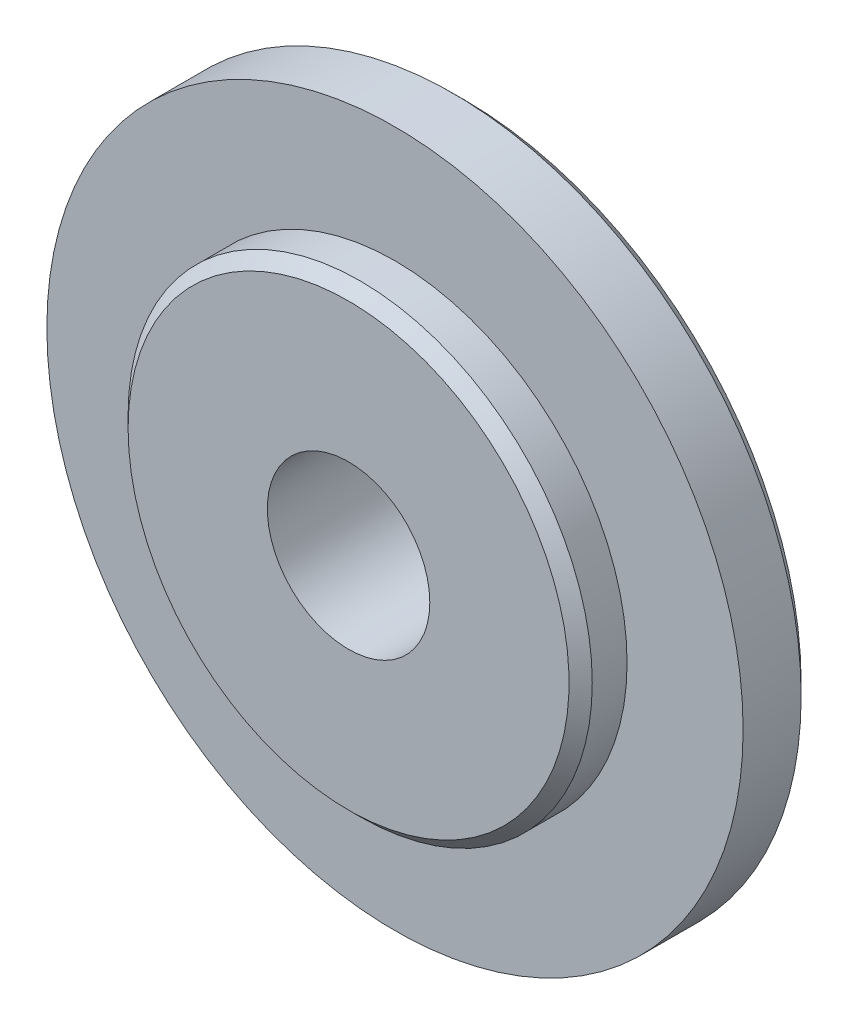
ISO-10303-21;
HEADER;
FILE_DESCRIPTION(('STEP AP214'),'2;1');
FILE_NAME('part.step','',(''),(''),'','','');
FILE_SCHEMA(('AUTOMOTIVE_DESIGN { 1 0 10303 214 1 1 1 1 }'));
ENDSEC;
DATA;
#1=APPLICATION_CONTEXT('core data for automotive mechanical design processes');
#2=APPLICATION_PROTOCOL_DEFINITION('international standard','automotive_design',2000,#1);
#3=PRODUCT_CONTEXT('',#1,'mechanical');
#4=PRODUCT('Part','Part','',(#3));
#5=PRODUCT_RELATED_PRODUCT_CATEGORY('part','',(#4));
#6=PRODUCT_DEFINITION_FORMATION('','',#4);
#7=PRODUCT_DEFINITION_CONTEXT('part definition',#1,'design');
#8=PRODUCT_DEFINITION('design','',#6,#7);
#9=PRODUCT_DEFINITION_SHAPE('','',#8);
#10=(LENGTH_UNIT() NAMED_UNIT(*) SI_UNIT(.MILLI.,.METRE.));
#11=(NAMED_UNIT(*) PLANE_ANGLE_UNIT() SI_UNIT($,.RADIAN.));
#12=(NAMED_UNIT(*) SI_UNIT($,.STERADIAN.) SOLID_ANGLE_UNIT());
#13=UNCERTAINTY_MEASURE_WITH_UNIT(LENGTH_MEASURE(1.E-05),#10,'distance_accuracy_value','');
#14=(GEOMETRIC_REPRESENTATION_CONTEXT(3) GLOBAL_UNCERTAINTY_ASSIGNED_CONTEXT((#13)) GLOBAL_UNIT_ASSIGNED_CONTEXT((#10,
#11,#12)) REPRESENTATION_CONTEXT('',''));
#15=CARTESIAN_POINT('',(0.,0.,0.));
#16=DIRECTION('',(0.,0.,1.));
#17=DIRECTION('',(1.,0.,0.));
#18=AXIS2_PLACEMENT_3D('',#15,#16,#17);
#19=CARTESIAN_POINT('',(0.,0.,6.));
#20=DIRECTION('',(0.,0.,1.));
#21=DIRECTION('',(1.,0.,0.));
#22=AXIS2_PLACEMENT_3D('',#19,#20,#21);
#23=CYLINDRICAL_SURFACE('',#22,20.);
#24=CARTESIAN_POINT('',(0.,0.,6.));
#25=DIRECTION('',(0.,0.,1.));
#26=DIRECTION('',(1.,0.,0.));
#27=AXIS2_PLACEMENT_3D('',#24,#25,#26);
#28=CIRCLE('',#27,20.);
#29=CARTESIAN_POINT('',(20.,0.,6.));
#30=VERTEX_POINT('',#29);
#31=EDGE_CURVE('E18',#30,#30,#28,.T.);
#32=ORIENTED_EDGE('',*,*,#31,.T.);
#33=EDGE_LOOP('',(#32));
#34=FACE_BOUND('',#33,.T.);
#35=CARTESIAN_POINT('',(0.,0.,8.99999999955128));
#36=DIRECTION('',(0.,0.,-1.));
#37=DIRECTION('',(-1.,0.,0.));
#38=AXIS2_PLACEMENT_3D('',#35,#36,#37);
#39=CIRCLE('',#38,19.9999999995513);
#40=CARTESIAN_POINT('',(-19.9999999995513,0.,8.99999999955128));
#41=VERTEX_POINT('',#40);
#42=EDGE_CURVE('E30',#41,#41,#39,.F.);
#43=ORIENTED_EDGE('',*,*,#42,.F.);
#44=EDGE_LOOP('',(#43));
#45=FACE_BOUND('',#44,.T.);
#46=ADVANCED_FACE('F14',(#34,#45),#23,.T.);
#47=CARTESIAN_POINT('',(0.,0.,6.));
#48=DIRECTION('',(0.,0.,-1.));
#49=DIRECTION('',(-1.,0.,0.));
#50=AXIS2_PLACEMENT_3D('',#47,#48,#49);
#51=PLANE('',#50);
#52=ORIENTED_EDGE('',*,*,#31,.F.);
#53=EDGE_LOOP('',(#52));
#54=FACE_BOUND('',#53,.T.);
#55=CARTESIAN_POINT('',(0.,0.,6.));
#56=DIRECTION('',(0.,0.,1.));
#57=DIRECTION('',(1.,0.,0.));
#58=AXIS2_PLACEMENT_3D('',#55,#56,#57);
#59=CIRCLE('',#58,30.);
#60=CARTESIAN_POINT('',(30.,0.,6.));
#61=VERTEX_POINT('',#60);
#62=EDGE_CURVE('E38',#61,#61,#59,.F.);
#63=ORIENTED_EDGE('',*,*,#62,.F.);
#64=EDGE_LOOP('',(#63));
#65=FACE_BOUND('',#64,.T.);
#66=ADVANCED_FACE('F50',(#54,#65),#51,.F.);
#67=CARTESIAN_POINT('',(0.,0.,8.99999999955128));
#68=DIRECTION('',(0.,0.,-1.));
#69=DIRECTION('',(-1.,0.,0.));
#70=AXIS2_PLACEMENT_3D('',#67,#68,#69);
#71=CONICAL_SURFACE('',#70,19.9999999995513,0.785398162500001);
#72=ORIENTED_EDGE('',*,*,#42,.T.);
#73=EDGE_LOOP('',(#72));
#74=FACE_BOUND('',#73,.T.);
#75=CARTESIAN_POINT('',(0.,0.,10.0000000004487));
#76=DIRECTION('',(0.,0.,-1.));
#77=DIRECTION('',(-1.,0.,0.));
#78=AXIS2_PLACEMENT_3D('',#75,#76,#77);
#79=CIRCLE('',#78,19.0000000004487);
#80=CARTESIAN_POINT('',(-19.0000000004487,0.,10.0000000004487));
#81=VERTEX_POINT('',#80);
#82=EDGE_CURVE('E36',#81,#81,#79,.T.);
#83=ORIENTED_EDGE('',*,*,#82,.T.);
#84=EDGE_LOOP('',(#83));
#85=FACE_BOUND('',#84,.T.);
#86=ADVANCED_FACE('F53',(#74,#85),#71,.T.);
#87=CARTESIAN_POINT('',(0.,0.,0.));
#88=DIRECTION('',(0.,0.,1.));
#89=DIRECTION('',(1.,0.,0.));
#90=AXIS2_PLACEMENT_3D('',#87,#88,#89);
#91=CYLINDRICAL_SURFACE('',#90,30.);
#92=CARTESIAN_POINT('',(0.,0.,1.00000000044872));
#93=DIRECTION('',(0.,0.,1.));
#94=DIRECTION('',(-1.,0.,0.));
#95=AXIS2_PLACEMENT_3D('',#92,#93,#94);
#96=CIRCLE('',#95,29.9999999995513);
#97=CARTESIAN_POINT('',(-29.9999999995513,0.,1.00000000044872));
#98=VERTEX_POINT('',#97);
#99=EDGE_CURVE('E35',#98,#98,#96,.F.);
#100=ORIENTED_EDGE('',*,*,#99,.F.);
#101=EDGE_LOOP('',(#100));
#102=FACE_BOUND('',#101,.T.);
#103=ORIENTED_EDGE('',*,*,#62,.T.);
#104=EDGE_LOOP('',(#103));
#105=FACE_BOUND('',#104,.T.);
#106=ADVANCED_FACE('F58',(#102,#105),#91,.T.);
#107=CARTESIAN_POINT('',(0.,0.,10.));
#108=DIRECTION('',(0.,0.,-1.));
#109=DIRECTION('',(-1.,0.,0.));
#110=AXIS2_PLACEMENT_3D('',#107,#108,#109);
#111=PLANE('',#110);
#112=CARTESIAN_POINT('',(0.,0.,10.));
#113=DIRECTION('',(0.,0.,1.));
#114=DIRECTION('',(1.,0.,0.));
#115=AXIS2_PLACEMENT_3D('',#112,#113,#114);
#116=CIRCLE('',#115,7.);
#117=CARTESIAN_POINT('',(7.,0.,10.));
#118=VERTEX_POINT('',#117);
#119=EDGE_CURVE('E27',#118,#118,#116,.F.);
#120=ORIENTED_EDGE('',*,*,#119,.T.);
#121=EDGE_LOOP('',(#120));
#122=FACE_BOUND('',#121,.T.);
#123=ORIENTED_EDGE('',*,*,#82,.F.);
#124=EDGE_LOOP('',(#123));
#125=FACE_BOUND('',#124,.T.);
#126=ADVANCED_FACE('F72',(#122,#125),#111,.F.);
#127=CARTESIAN_POINT('',(0.,0.,1.00000000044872));
#128=DIRECTION('',(0.,0.,1.));
#129=DIRECTION('',(0.,-1.,0.));
#130=AXIS2_PLACEMENT_3D('',#127,#128,#129);
#131=CONICAL_SURFACE('',#130,29.9999999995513,0.7853981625);
#132=CARTESIAN_POINT('',(0.,0.,-4.48720921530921E-10));
#133=DIRECTION('',(0.,0.,1.));
#134=DIRECTION('',(0.,-1.,0.));
#135=AXIS2_PLACEMENT_3D('',#132,#133,#134);
#136=CIRCLE('',#135,29.0000000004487);
#137=CARTESIAN_POINT('',(0.,-29.0000000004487,-4.48721026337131E-10));
#138=VERTEX_POINT('',#137);
#139=EDGE_CURVE('E22',#138,#138,#136,.F.);
#140=ORIENTED_EDGE('',*,*,#139,.F.);
#141=EDGE_LOOP('',(#140));
#142=FACE_BOUND('',#141,.T.);
#143=ORIENTED_EDGE('',*,*,#99,.T.);
#144=EDGE_LOOP('',(#143));
#145=FACE_BOUND('',#144,.T.);
#146=ADVANCED_FACE('F66',(#142,#145),#131,.T.);
#147=CARTESIAN_POINT('',(0.,0.,0.));
#148=DIRECTION('',(0.,0.,1.));
#149=DIRECTION('',(1.,0.,0.));
#150=AXIS2_PLACEMENT_3D('',#147,#148,#149);
#151=CYLINDRICAL_SURFACE('',#150,7.);
#152=CARTESIAN_POINT('',(0.,0.,0.));
#153=DIRECTION('',(0.,0.,1.));
#154=DIRECTION('',(1.,0.,0.));
#155=AXIS2_PLACEMENT_3D('',#152,#153,#154);
#156=CIRCLE('',#155,7.);
#157=CARTESIAN_POINT('',(7.,0.,0.));
#158=VERTEX_POINT('',#157);
#159=EDGE_CURVE('E9',#158,#158,#156,.T.);
#160=ORIENTED_EDGE('',*,*,#159,.F.);
#161=EDGE_LOOP('',(#160));
#162=FACE_BOUND('',#161,.T.);
#163=ORIENTED_EDGE('',*,*,#119,.F.);
#164=EDGE_LOOP('',(#163));
#165=FACE_BOUND('',#164,.T.);
#166=ADVANCED_FACE('F16',(#162,#165),#151,.F.);
#167=CARTESIAN_POINT('',(0.,0.,0.));
#168=DIRECTION('',(0.,0.,-1.));
#169=DIRECTION('',(-1.,0.,0.));
#170=AXIS2_PLACEMENT_3D('',#167,#168,#169);
#171=PLANE('',#170);
#172=ORIENTED_EDGE('',*,*,#159,.T.);
#173=EDGE_LOOP('',(#172));
#174=FACE_BOUND('',#173,.T.);
#175=ORIENTED_EDGE('',*,*,#139,.T.);
#176=EDGE_LOOP('',(#175));
#177=FACE_BOUND('',#176,.T.);
#178=ADVANCED_FACE('F62',(#174,#177),#171,.T.);
#179=CLOSED_SHELL('',(#46,#66,#86,#106,#126,#146,#166,#178));
#180=MANIFOLD_SOLID_BREP('B1',#179);
#181=ADVANCED_BREP_SHAPE_REPRESENTATION('',(#18,#180),#14);
#182=SHAPE_DEFINITION_REPRESENTATION(#9,#181);
ENDSEC;
END-ISO-10303-21;
